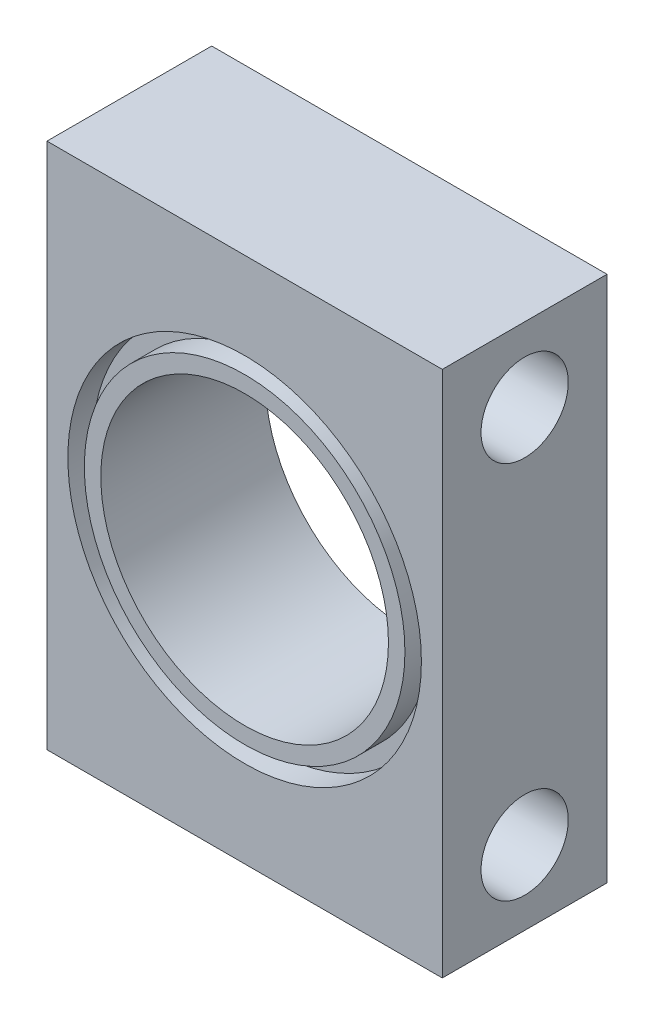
from build123d import *

# Parameters (mm, degrees)
SKETCH1_R                = 8.73125
BOSS_EXTRUDE1_DEPTH      = 5
M5_CLEARANCE_HOLE1_D     = 5.3
M5_CLEARANCE_HOLE1_DEPTH = 25.4
M5_CLEARANCE_HOLE1_TIP   = 1.59228064
SKETCH6_R                = 10.73125
SKETCH6_R_2              = 9.73125
CUT_EXTRUDE3_DEPTH       = 1.5


with BuildPart() as part:
    # Sketch1 → Boss-Extrude1 (new, symmetric)
    with BuildSketch(Plane.XY):
        Polygon((0, 16), (-12, 16), (-12, -16), (0, -16), (12, -16), (12, 16), align=None)
        Circle(SKETCH1_R, mode=Mode.SUBTRACT)
    extrude(amount=BOSS_EXTRUDE1_DEPTH, both=True)

    # M5 Clearance Hole1
    with Locations(Plane(origin=(-13.4, 11.5, 0), x_dir=(0, -1, 0), z_dir=(-1, 0, 0))):
        with Locations((0, 0), (23, 0)):
            Hole(M5_CLEARANCE_HOLE1_D / 2, depth=M5_CLEARANCE_HOLE1_DEPTH)
            with Locations((0, 0, -(M5_CLEARANCE_HOLE1_DEPTH + M5_CLEARANCE_HOLE1_TIP / 2))):  # 118° drill point
                Cone(0, M5_CLEARANCE_HOLE1_D / 2, M5_CLEARANCE_HOLE1_TIP, mode=Mode.SUBTRACT)

    # Sketch6 → Cut-Extrude3 (cut)
    with BuildSketch(Plane.XY.offset(5)):
        Circle(SKETCH6_R)
        Circle(SKETCH6_R_2, mode=Mode.SUBTRACT)
    extrude(amount=-CUT_EXTRUDE3_DEPTH, mode=Mode.SUBTRACT)


solid = part.part
